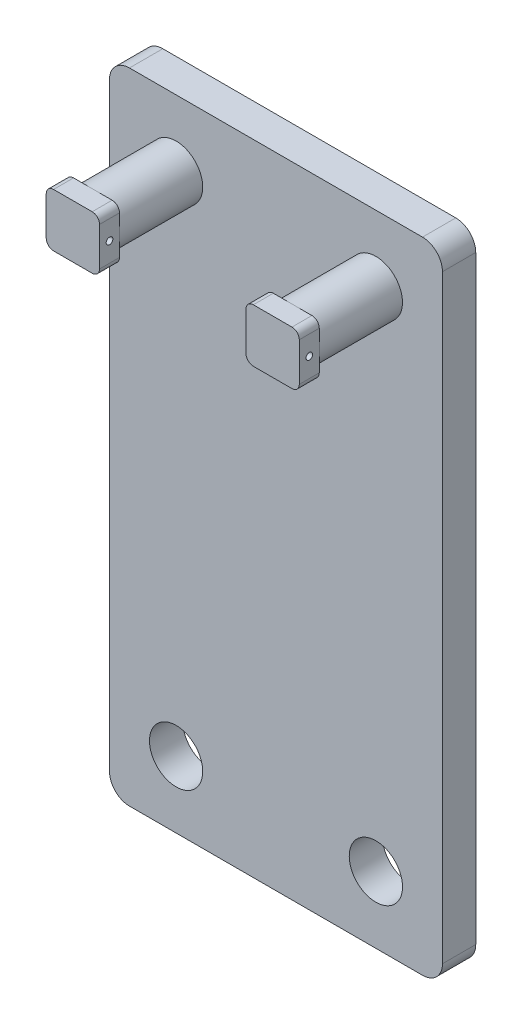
ISO-10303-21;
HEADER;
FILE_DESCRIPTION(('STEP AP214'),'2;1');
FILE_NAME('part.step','',(''),(''),'','','');
FILE_SCHEMA(('AUTOMOTIVE_DESIGN { 1 0 10303 214 1 1 1 1 }'));
ENDSEC;
DATA;
#1=APPLICATION_CONTEXT('core data for automotive mechanical design processes');
#2=APPLICATION_PROTOCOL_DEFINITION('international standard','automotive_design',2000,#1);
#3=PRODUCT_CONTEXT('',#1,'mechanical');
#4=PRODUCT('Part','Part','',(#3));
#5=PRODUCT_RELATED_PRODUCT_CATEGORY('part','',(#4));
#6=PRODUCT_DEFINITION_FORMATION('','',#4);
#7=PRODUCT_DEFINITION_CONTEXT('part definition',#1,'design');
#8=PRODUCT_DEFINITION('design','',#6,#7);
#9=PRODUCT_DEFINITION_SHAPE('','',#8);
#10=(LENGTH_UNIT() NAMED_UNIT(*) SI_UNIT(.MILLI.,.METRE.));
#11=(NAMED_UNIT(*) PLANE_ANGLE_UNIT() SI_UNIT($,.RADIAN.));
#12=(NAMED_UNIT(*) SI_UNIT($,.STERADIAN.) SOLID_ANGLE_UNIT());
#13=UNCERTAINTY_MEASURE_WITH_UNIT(LENGTH_MEASURE(1.E-05),#10,'distance_accuracy_value','');
#14=(GEOMETRIC_REPRESENTATION_CONTEXT(3) GLOBAL_UNCERTAINTY_ASSIGNED_CONTEXT((#13)) GLOBAL_UNIT_ASSIGNED_CONTEXT((#10,
#11,#12)) REPRESENTATION_CONTEXT('',''));
#15=CARTESIAN_POINT('',(0.,0.,0.));
#16=DIRECTION('',(0.,0.,1.));
#17=DIRECTION('',(1.,0.,0.));
#18=AXIS2_PLACEMENT_3D('',#15,#16,#17);
#19=CARTESIAN_POINT('',(179.,-15.6883506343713,205.));
#20=DIRECTION('',(0.,0.,-1.));
#21=DIRECTION('',(-1.,0.,0.));
#22=AXIS2_PLACEMENT_3D('',#19,#20,#21);
#23=CYLINDRICAL_SURFACE('',#22,11.);
#24=DIRECTION('',(0.,0.,-1.));
#25=VECTOR('',#24,1.);
#26=CARTESIAN_POINT('',(179.,-4.68835063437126,205.));
#27=LINE('',#26,#25);
#28=CARTESIAN_POINT('',(179.,-4.68835063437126,205.));
#29=VERTEX_POINT('',#28);
#30=CARTESIAN_POINT('',(179.,-4.68835063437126,175.));
#31=VERTEX_POINT('',#30);
#32=EDGE_CURVE('E448',#29,#31,#27,.T.);
#33=ORIENTED_EDGE('',*,*,#32,.F.);
#34=CARTESIAN_POINT('',(179.,-15.6883506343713,205.));
#35=DIRECTION('',(0.,0.,1.));
#36=DIRECTION('',(1.,0.,0.));
#37=AXIS2_PLACEMENT_3D('',#34,#35,#36);
#38=CIRCLE('',#37,11.);
#39=CARTESIAN_POINT('',(190.,-15.6883506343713,205.));
#40=VERTEX_POINT('',#39);
#41=EDGE_CURVE('E41',#40,#29,#38,.T.);
#42=ORIENTED_EDGE('',*,*,#41,.F.);
#43=DIRECTION('',(0.,0.,-1.));
#44=VECTOR('',#43,1.);
#45=CARTESIAN_POINT('',(190.,-15.6883506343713,205.));
#46=LINE('',#45,#44);
#47=CARTESIAN_POINT('',(190.,-15.6883506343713,175.));
#48=VERTEX_POINT('',#47);
#49=EDGE_CURVE('E451',#48,#40,#46,.F.);
#50=ORIENTED_EDGE('',*,*,#49,.F.);
#51=CARTESIAN_POINT('',(179.,-15.6883506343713,175.));
#52=DIRECTION('',(0.,0.,1.));
#53=DIRECTION('',(1.,0.,0.));
#54=AXIS2_PLACEMENT_3D('',#51,#52,#53);
#55=CIRCLE('',#54,11.);
#56=EDGE_CURVE('E11',#31,#48,#55,.F.);
#57=ORIENTED_EDGE('',*,*,#56,.F.);
#58=EDGE_LOOP('',(#33,#42,#50,#57));
#59=FACE_BOUND('',#58,.T.);
#60=ADVANCED_FACE('F34',(#59),#23,.T.);
#61=CARTESIAN_POINT('',(179.,-73.6883506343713,205.));
#62=DIRECTION('',(0.,0.,-1.));
#63=DIRECTION('',(-1.,0.,0.));
#64=AXIS2_PLACEMENT_3D('',#61,#62,#63);
#65=CYLINDRICAL_SURFACE('',#64,11.);
#66=DIRECTION('',(0.,0.,-1.));
#67=VECTOR('',#66,1.);
#68=CARTESIAN_POINT('',(190.,-73.6883506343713,205.));
#69=LINE('',#68,#67);
#70=CARTESIAN_POINT('',(190.,-73.6883506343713,205.));
#71=VERTEX_POINT('',#70);
#72=CARTESIAN_POINT('',(190.,-73.6883506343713,175.));
#73=VERTEX_POINT('',#72);
#74=EDGE_CURVE('E437',#71,#73,#69,.T.);
#75=ORIENTED_EDGE('',*,*,#74,.F.);
#76=CARTESIAN_POINT('',(179.,-73.6883506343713,205.));
#77=DIRECTION('',(0.,0.,1.));
#78=DIRECTION('',(1.,0.,0.));
#79=AXIS2_PLACEMENT_3D('',#76,#77,#78);
#80=CIRCLE('',#79,11.);
#81=CARTESIAN_POINT('',(179.,-84.6883506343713,205.));
#82=VERTEX_POINT('',#81);
#83=EDGE_CURVE('E443',#82,#71,#80,.T.);
#84=ORIENTED_EDGE('',*,*,#83,.F.);
#85=DIRECTION('',(0.,0.,-1.));
#86=VECTOR('',#85,1.);
#87=CARTESIAN_POINT('',(179.,-84.6883506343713,205.));
#88=LINE('',#87,#86);
#89=CARTESIAN_POINT('',(179.,-84.6883506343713,175.));
#90=VERTEX_POINT('',#89);
#91=EDGE_CURVE('E440',#90,#82,#88,.F.);
#92=ORIENTED_EDGE('',*,*,#91,.F.);
#93=CARTESIAN_POINT('',(179.,-73.6883506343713,175.));
#94=DIRECTION('',(0.,0.,1.));
#95=DIRECTION('',(1.,0.,0.));
#96=AXIS2_PLACEMENT_3D('',#93,#94,#95);
#97=CIRCLE('',#96,11.);
#98=EDGE_CURVE('E446',#73,#90,#97,.F.);
#99=ORIENTED_EDGE('',*,*,#98,.F.);
#100=EDGE_LOOP('',(#75,#84,#92,#99));
#101=FACE_BOUND('',#100,.T.);
#102=ADVANCED_FACE('F481',(#101),#65,.T.);
#103=CARTESIAN_POINT('',(121.,-73.6883506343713,205.));
#104=DIRECTION('',(0.,0.,-1.));
#105=DIRECTION('',(-1.,0.,0.));
#106=AXIS2_PLACEMENT_3D('',#103,#104,#105);
#107=CYLINDRICAL_SURFACE('',#106,11.);
#108=DIRECTION('',(0.,0.,-1.));
#109=VECTOR('',#108,1.);
#110=CARTESIAN_POINT('',(121.,-84.6883506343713,205.));
#111=LINE('',#110,#109);
#112=CARTESIAN_POINT('',(121.,-84.6883506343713,205.));
#113=VERTEX_POINT('',#112);
#114=CARTESIAN_POINT('',(121.,-84.6883506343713,175.));
#115=VERTEX_POINT('',#114);
#116=EDGE_CURVE('E428',#113,#115,#111,.T.);
#117=ORIENTED_EDGE('',*,*,#116,.F.);
#118=CARTESIAN_POINT('',(121.,-73.6883506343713,205.));
#119=DIRECTION('',(0.,0.,1.));
#120=DIRECTION('',(1.,0.,0.));
#121=AXIS2_PLACEMENT_3D('',#118,#119,#120);
#122=CIRCLE('',#121,11.);
#123=CARTESIAN_POINT('',(110.,-73.6883506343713,205.));
#124=VERTEX_POINT('',#123);
#125=EDGE_CURVE('E433',#124,#113,#122,.T.);
#126=ORIENTED_EDGE('',*,*,#125,.F.);
#127=DIRECTION('',(0.,0.,-1.));
#128=VECTOR('',#127,1.);
#129=CARTESIAN_POINT('',(110.,-73.6883506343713,205.));
#130=LINE('',#129,#128);
#131=CARTESIAN_POINT('',(110.,-73.6883506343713,175.));
#132=VERTEX_POINT('',#131);
#133=EDGE_CURVE('E431',#132,#124,#130,.F.);
#134=ORIENTED_EDGE('',*,*,#133,.F.);
#135=CARTESIAN_POINT('',(121.,-73.6883506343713,175.));
#136=DIRECTION('',(0.,0.,1.));
#137=DIRECTION('',(1.,0.,0.));
#138=AXIS2_PLACEMENT_3D('',#135,#136,#137);
#139=CIRCLE('',#138,11.);
#140=EDGE_CURVE('E221',#115,#132,#139,.F.);
#141=ORIENTED_EDGE('',*,*,#140,.F.);
#142=EDGE_LOOP('',(#117,#126,#134,#141));
#143=FACE_BOUND('',#142,.T.);
#144=ADVANCED_FACE('F485',(#143),#107,.T.);
#145=CARTESIAN_POINT('',(121.,-15.6883506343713,205.));
#146=DIRECTION('',(0.,0.,1.));
#147=DIRECTION('',(1.,0.,0.));
#148=AXIS2_PLACEMENT_3D('',#145,#146,#147);
#149=CYLINDRICAL_SURFACE('',#148,11.);
#150=DIRECTION('',(0.,0.,1.));
#151=VECTOR('',#150,1.);
#152=CARTESIAN_POINT('',(121.,-4.68835063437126,205.));
#153=LINE('',#152,#151);
#154=CARTESIAN_POINT('',(121.,-4.68835063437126,175.));
#155=VERTEX_POINT('',#154);
#156=CARTESIAN_POINT('',(121.,-4.68835063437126,205.));
#157=VERTEX_POINT('',#156);
#158=EDGE_CURVE('E419',#155,#157,#153,.T.);
#159=ORIENTED_EDGE('',*,*,#158,.F.);
#160=CARTESIAN_POINT('',(121.,-15.6883506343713,175.));
#161=DIRECTION('',(0.,0.,1.));
#162=DIRECTION('',(1.,0.,0.));
#163=AXIS2_PLACEMENT_3D('',#160,#161,#162);
#164=CIRCLE('',#163,11.);
#165=CARTESIAN_POINT('',(110.,-15.6883506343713,175.));
#166=VERTEX_POINT('',#165);
#167=EDGE_CURVE('E423',#166,#155,#164,.F.);
#168=ORIENTED_EDGE('',*,*,#167,.F.);
#169=DIRECTION('',(0.,0.,1.));
#170=VECTOR('',#169,1.);
#171=CARTESIAN_POINT('',(110.,-15.6883506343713,205.));
#172=LINE('',#171,#170);
#173=CARTESIAN_POINT('',(110.,-15.6883506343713,205.));
#174=VERTEX_POINT('',#173);
#175=EDGE_CURVE('E252',#174,#166,#172,.F.);
#176=ORIENTED_EDGE('',*,*,#175,.F.);
#177=CARTESIAN_POINT('',(121.,-15.6883506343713,205.));
#178=DIRECTION('',(0.,0.,1.));
#179=DIRECTION('',(1.,0.,0.));
#180=AXIS2_PLACEMENT_3D('',#177,#178,#179);
#181=CIRCLE('',#180,11.);
#182=EDGE_CURVE('E425',#157,#174,#181,.T.);
#183=ORIENTED_EDGE('',*,*,#182,.F.);
#184=EDGE_LOOP('',(#159,#168,#176,#183));
#185=FACE_BOUND('',#184,.T.);
#186=ADVANCED_FACE('F490',(#185),#149,.T.);
#187=CARTESIAN_POINT('',(-179.,-73.6883506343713,205.));
#188=DIRECTION('',(0.,0.,1.));
#189=DIRECTION('',(1.,0.,0.));
#190=AXIS2_PLACEMENT_3D('',#187,#188,#189);
#191=CYLINDRICAL_SURFACE('',#190,11.);
#192=DIRECTION('',(0.,0.,1.));
#193=VECTOR('',#192,1.);
#194=CARTESIAN_POINT('',(-190.,-73.6883506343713,205.));
#195=LINE('',#194,#193);
#196=CARTESIAN_POINT('',(-190.,-73.6883506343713,175.));
#197=VERTEX_POINT('',#196);
#198=CARTESIAN_POINT('',(-190.,-73.6883506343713,205.));
#199=VERTEX_POINT('',#198);
#200=EDGE_CURVE('E409',#197,#199,#195,.T.);
#201=ORIENTED_EDGE('',*,*,#200,.F.);
#202=CARTESIAN_POINT('',(-179.,-73.6883506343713,175.));
#203=DIRECTION('',(0.,0.,1.));
#204=DIRECTION('',(1.,0.,0.));
#205=AXIS2_PLACEMENT_3D('',#202,#203,#204);
#206=CIRCLE('',#205,11.);
#207=CARTESIAN_POINT('',(-179.,-84.6883506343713,175.));
#208=VERTEX_POINT('',#207);
#209=EDGE_CURVE('E415',#208,#197,#206,.F.);
#210=ORIENTED_EDGE('',*,*,#209,.F.);
#211=DIRECTION('',(0.,0.,1.));
#212=VECTOR('',#211,1.);
#213=CARTESIAN_POINT('',(-179.,-84.6883506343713,205.));
#214=LINE('',#213,#212);
#215=CARTESIAN_POINT('',(-179.,-84.6883506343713,205.));
#216=VERTEX_POINT('',#215);
#217=EDGE_CURVE('E412',#216,#208,#214,.F.);
#218=ORIENTED_EDGE('',*,*,#217,.F.);
#219=CARTESIAN_POINT('',(-179.,-73.6883506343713,205.));
#220=DIRECTION('',(0.,0.,1.));
#221=DIRECTION('',(1.,0.,0.));
#222=AXIS2_PLACEMENT_3D('',#219,#220,#221);
#223=CIRCLE('',#222,11.);
#224=EDGE_CURVE('E417',#199,#216,#223,.T.);
#225=ORIENTED_EDGE('',*,*,#224,.F.);
#226=EDGE_LOOP('',(#201,#210,#218,#225));
#227=FACE_BOUND('',#226,.T.);
#228=ADVANCED_FACE('F497',(#227),#191,.T.);
#229=CARTESIAN_POINT('',(-121.,-73.6883506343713,205.));
#230=DIRECTION('',(0.,0.,-1.));
#231=DIRECTION('',(-1.,0.,0.));
#232=AXIS2_PLACEMENT_3D('',#229,#230,#231);
#233=CYLINDRICAL_SURFACE('',#232,11.);
#234=DIRECTION('',(0.,0.,-1.));
#235=VECTOR('',#234,1.);
#236=CARTESIAN_POINT('',(-110.,-73.6883506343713,205.));
#237=LINE('',#236,#235);
#238=CARTESIAN_POINT('',(-110.,-73.6883506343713,205.));
#239=VERTEX_POINT('',#238);
#240=CARTESIAN_POINT('',(-110.,-73.6883506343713,175.));
#241=VERTEX_POINT('',#240);
#242=EDGE_CURVE('E399',#239,#241,#237,.T.);
#243=ORIENTED_EDGE('',*,*,#242,.F.);
#244=CARTESIAN_POINT('',(-121.,-73.6883506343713,205.));
#245=DIRECTION('',(0.,0.,1.));
#246=DIRECTION('',(1.,0.,0.));
#247=AXIS2_PLACEMENT_3D('',#244,#245,#246);
#248=CIRCLE('',#247,11.);
#249=CARTESIAN_POINT('',(-121.,-84.6883506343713,205.));
#250=VERTEX_POINT('',#249);
#251=EDGE_CURVE('E405',#250,#239,#248,.T.);
#252=ORIENTED_EDGE('',*,*,#251,.F.);
#253=DIRECTION('',(0.,0.,-1.));
#254=VECTOR('',#253,1.);
#255=CARTESIAN_POINT('',(-121.,-84.6883506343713,205.));
#256=LINE('',#255,#254);
#257=CARTESIAN_POINT('',(-121.,-84.6883506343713,175.));
#258=VERTEX_POINT('',#257);
#259=EDGE_CURVE('E402',#258,#250,#256,.F.);
#260=ORIENTED_EDGE('',*,*,#259,.F.);
#261=CARTESIAN_POINT('',(-121.,-73.6883506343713,175.));
#262=DIRECTION('',(0.,0.,1.));
#263=DIRECTION('',(1.,0.,0.));
#264=AXIS2_PLACEMENT_3D('',#261,#262,#263);
#265=CIRCLE('',#264,11.);
#266=EDGE_CURVE('E407',#241,#258,#265,.F.);
#267=ORIENTED_EDGE('',*,*,#266,.F.);
#268=EDGE_LOOP('',(#243,#252,#260,#267));
#269=FACE_BOUND('',#268,.T.);
#270=ADVANCED_FACE('F501',(#269),#233,.T.);
#271=CARTESIAN_POINT('',(-121.,-15.6883506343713,205.));
#272=DIRECTION('',(0.,0.,-1.));
#273=DIRECTION('',(-1.,0.,0.));
#274=AXIS2_PLACEMENT_3D('',#271,#272,#273);
#275=CYLINDRICAL_SURFACE('',#274,11.);
#276=DIRECTION('',(0.,0.,-1.));
#277=VECTOR('',#276,1.);
#278=CARTESIAN_POINT('',(-121.,-4.68835063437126,205.));
#279=LINE('',#278,#277);
#280=CARTESIAN_POINT('',(-121.,-4.68835063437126,205.));
#281=VERTEX_POINT('',#280);
#282=CARTESIAN_POINT('',(-121.,-4.68835063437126,175.));
#283=VERTEX_POINT('',#282);
#284=EDGE_CURVE('E389',#281,#283,#279,.T.);
#285=ORIENTED_EDGE('',*,*,#284,.F.);
#286=CARTESIAN_POINT('',(-121.,-15.6883506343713,205.));
#287=DIRECTION('',(0.,0.,1.));
#288=DIRECTION('',(1.,0.,0.));
#289=AXIS2_PLACEMENT_3D('',#286,#287,#288);
#290=CIRCLE('',#289,11.);
#291=CARTESIAN_POINT('',(-110.,-15.6883506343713,205.));
#292=VERTEX_POINT('',#291);
#293=EDGE_CURVE('E395',#292,#281,#290,.T.);
#294=ORIENTED_EDGE('',*,*,#293,.F.);
#295=DIRECTION('',(0.,0.,-1.));
#296=VECTOR('',#295,1.);
#297=CARTESIAN_POINT('',(-110.,-15.6883506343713,205.));
#298=LINE('',#297,#296);
#299=CARTESIAN_POINT('',(-110.,-15.6883506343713,175.));
#300=VERTEX_POINT('',#299);
#301=EDGE_CURVE('E392',#300,#292,#298,.F.);
#302=ORIENTED_EDGE('',*,*,#301,.F.);
#303=CARTESIAN_POINT('',(-121.,-15.6883506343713,175.));
#304=DIRECTION('',(0.,0.,1.));
#305=DIRECTION('',(1.,0.,0.));
#306=AXIS2_PLACEMENT_3D('',#303,#304,#305);
#307=CIRCLE('',#306,11.);
#308=EDGE_CURVE('E397',#283,#300,#307,.F.);
#309=ORIENTED_EDGE('',*,*,#308,.F.);
#310=EDGE_LOOP('',(#285,#294,#302,#309));
#311=FACE_BOUND('',#310,.T.);
#312=ADVANCED_FACE('F505',(#311),#275,.T.);
#313=CARTESIAN_POINT('',(-179.,-15.6883506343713,205.));
#314=DIRECTION('',(0.,0.,1.));
#315=DIRECTION('',(1.,0.,0.));
#316=AXIS2_PLACEMENT_3D('',#313,#314,#315);
#317=CYLINDRICAL_SURFACE('',#316,11.);
#318=DIRECTION('',(0.,0.,1.));
#319=VECTOR('',#318,1.);
#320=CARTESIAN_POINT('',(-179.,-4.68835063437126,205.));
#321=LINE('',#320,#319);
#322=CARTESIAN_POINT('',(-179.,-4.68835063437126,175.));
#323=VERTEX_POINT('',#322);
#324=CARTESIAN_POINT('',(-179.,-4.68835063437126,205.));
#325=VERTEX_POINT('',#324);
#326=EDGE_CURVE('E375',#323,#325,#321,.T.);
#327=ORIENTED_EDGE('',*,*,#326,.F.);
#328=CARTESIAN_POINT('',(-179.,-15.6883506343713,175.));
#329=DIRECTION('',(0.,0.,1.));
#330=DIRECTION('',(1.,0.,0.));
#331=AXIS2_PLACEMENT_3D('',#328,#329,#330);
#332=CIRCLE('',#331,11.);
#333=CARTESIAN_POINT('',(-190.,-15.6883506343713,175.));
#334=VERTEX_POINT('',#333);
#335=EDGE_CURVE('E385',#334,#323,#332,.F.);
#336=ORIENTED_EDGE('',*,*,#335,.F.);
#337=DIRECTION('',(0.,0.,1.));
#338=VECTOR('',#337,1.);
#339=CARTESIAN_POINT('',(-190.,-15.6883506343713,205.));
#340=LINE('',#339,#338);
#341=CARTESIAN_POINT('',(-190.,-15.6883506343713,205.));
#342=VERTEX_POINT('',#341);
#343=EDGE_CURVE('E382',#342,#334,#340,.F.);
#344=ORIENTED_EDGE('',*,*,#343,.F.);
#345=CARTESIAN_POINT('',(-179.,-15.6883506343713,205.));
#346=DIRECTION('',(0.,0.,1.));
#347=DIRECTION('',(1.,0.,0.));
#348=AXIS2_PLACEMENT_3D('',#345,#346,#347);
#349=CIRCLE('',#348,11.);
#350=EDGE_CURVE('E387',#325,#342,#349,.T.);
#351=ORIENTED_EDGE('',*,*,#350,.F.);
#352=EDGE_LOOP('',(#327,#336,#344,#351));
#353=FACE_BOUND('',#352,.T.);
#354=ADVANCED_FACE('F509',(#353),#317,.T.);
#355=CARTESIAN_POINT('',(220.,-874.688350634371,50.));
#356=DIRECTION('',(0.,0.,-1.));
#357=DIRECTION('',(-1.,0.,0.));
#358=AXIS2_PLACEMENT_3D('',#355,#356,#357);
#359=CYLINDRICAL_SURFACE('',#358,30.);
#360=DIRECTION('',(0.,0.,-1.));
#361=VECTOR('',#360,1.);
#362=CARTESIAN_POINT('',(250.,-874.688350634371,50.));
#363=LINE('',#362,#361);
#364=CARTESIAN_POINT('',(250.,-874.688350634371,50.));
#365=VERTEX_POINT('',#364);
#366=CARTESIAN_POINT('',(250.,-874.688350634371,0.));
#367=VERTEX_POINT('',#366);
#368=EDGE_CURVE('E365',#365,#367,#363,.T.);
#369=ORIENTED_EDGE('',*,*,#368,.F.);
#370=CARTESIAN_POINT('',(220.,-874.688350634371,50.));
#371=DIRECTION('',(0.,0.,1.));
#372=DIRECTION('',(1.,0.,0.));
#373=AXIS2_PLACEMENT_3D('',#370,#371,#372);
#374=CIRCLE('',#373,30.);
#375=CARTESIAN_POINT('',(220.,-904.688350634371,50.));
#376=VERTEX_POINT('',#375);
#377=EDGE_CURVE('E371',#376,#365,#374,.T.);
#378=ORIENTED_EDGE('',*,*,#377,.F.);
#379=DIRECTION('',(0.,0.,-1.));
#380=VECTOR('',#379,1.);
#381=CARTESIAN_POINT('',(220.,-904.688350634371,50.));
#382=LINE('',#381,#380);
#383=CARTESIAN_POINT('',(220.,-904.688350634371,0.));
#384=VERTEX_POINT('',#383);
#385=EDGE_CURVE('E368',#384,#376,#382,.F.);
#386=ORIENTED_EDGE('',*,*,#385,.F.);
#387=CARTESIAN_POINT('',(220.,-874.688350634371,0.));
#388=DIRECTION('',(0.,0.,1.));
#389=DIRECTION('',(1.,0.,0.));
#390=AXIS2_PLACEMENT_3D('',#387,#388,#389);
#391=CIRCLE('',#390,30.);
#392=EDGE_CURVE('E373',#367,#384,#391,.F.);
#393=ORIENTED_EDGE('',*,*,#392,.F.);
#394=EDGE_LOOP('',(#369,#378,#386,#393));
#395=FACE_BOUND('',#394,.T.);
#396=ADVANCED_FACE('F513',(#395),#359,.T.);
#397=CARTESIAN_POINT('',(-220.,-874.688350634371,50.));
#398=DIRECTION('',(0.,0.,1.));
#399=DIRECTION('',(1.,0.,0.));
#400=AXIS2_PLACEMENT_3D('',#397,#398,#399);
#401=CYLINDRICAL_SURFACE('',#400,30.);
#402=DIRECTION('',(0.,0.,1.));
#403=VECTOR('',#402,1.);
#404=CARTESIAN_POINT('',(-250.,-874.688350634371,50.));
#405=LINE('',#404,#403);
#406=CARTESIAN_POINT('',(-250.,-874.688350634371,0.));
#407=VERTEX_POINT('',#406);
#408=CARTESIAN_POINT('',(-250.,-874.688350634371,50.));
#409=VERTEX_POINT('',#408);
#410=EDGE_CURVE('E355',#407,#409,#405,.T.);
#411=ORIENTED_EDGE('',*,*,#410,.F.);
#412=CARTESIAN_POINT('',(-220.,-874.688350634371,0.));
#413=DIRECTION('',(0.,0.,1.));
#414=DIRECTION('',(1.,0.,0.));
#415=AXIS2_PLACEMENT_3D('',#412,#413,#414);
#416=CIRCLE('',#415,30.);
#417=CARTESIAN_POINT('',(-220.,-904.688350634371,0.));
#418=VERTEX_POINT('',#417);
#419=EDGE_CURVE('E361',#418,#407,#416,.F.);
#420=ORIENTED_EDGE('',*,*,#419,.F.);
#421=DIRECTION('',(0.,0.,1.));
#422=VECTOR('',#421,1.);
#423=CARTESIAN_POINT('',(-220.,-904.688350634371,50.));
#424=LINE('',#423,#422);
#425=CARTESIAN_POINT('',(-220.,-904.688350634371,50.));
#426=VERTEX_POINT('',#425);
#427=EDGE_CURVE('E358',#426,#418,#424,.F.);
#428=ORIENTED_EDGE('',*,*,#427,.F.);
#429=CARTESIAN_POINT('',(-220.,-874.688350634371,50.));
#430=DIRECTION('',(0.,0.,1.));
#431=DIRECTION('',(1.,0.,0.));
#432=AXIS2_PLACEMENT_3D('',#429,#430,#431);
#433=CIRCLE('',#432,30.);
#434=EDGE_CURVE('E363',#409,#426,#433,.T.);
#435=ORIENTED_EDGE('',*,*,#434,.F.);
#436=EDGE_LOOP('',(#411,#420,#428,#435));
#437=FACE_BOUND('',#436,.T.);
#438=ADVANCED_FACE('F517',(#437),#401,.T.);
#439=CARTESIAN_POINT('',(220.,25.3116493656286,50.));
#440=DIRECTION('',(0.,0.,-1.));
#441=DIRECTION('',(-1.,0.,0.));
#442=AXIS2_PLACEMENT_3D('',#439,#440,#441);
#443=CYLINDRICAL_SURFACE('',#442,30.);
#444=DIRECTION('',(0.,0.,-1.));
#445=VECTOR('',#444,1.);
#446=CARTESIAN_POINT('',(220.,55.3116493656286,50.));
#447=LINE('',#446,#445);
#448=CARTESIAN_POINT('',(220.,55.3116493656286,50.));
#449=VERTEX_POINT('',#448);
#450=CARTESIAN_POINT('',(220.,55.3116493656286,0.));
#451=VERTEX_POINT('',#450);
#452=EDGE_CURVE('E344',#449,#451,#447,.T.);
#453=ORIENTED_EDGE('',*,*,#452,.F.);
#454=CARTESIAN_POINT('',(220.,25.3116493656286,50.));
#455=DIRECTION('',(0.,0.,1.));
#456=DIRECTION('',(1.,0.,0.));
#457=AXIS2_PLACEMENT_3D('',#454,#455,#456);
#458=CIRCLE('',#457,30.);
#459=CARTESIAN_POINT('',(250.000000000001,25.3116493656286,50.));
#460=VERTEX_POINT('',#459);
#461=EDGE_CURVE('E350',#460,#449,#458,.T.);
#462=ORIENTED_EDGE('',*,*,#461,.F.);
#463=DIRECTION('',(0.,0.,-1.));
#464=VECTOR('',#463,1.);
#465=CARTESIAN_POINT('',(250.,25.3116493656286,50.));
#466=LINE('',#465,#464);
#467=CARTESIAN_POINT('',(250.,25.3116493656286,0.));
#468=VERTEX_POINT('',#467);
#469=EDGE_CURVE('E347',#468,#460,#466,.F.);
#470=ORIENTED_EDGE('',*,*,#469,.F.);
#471=CARTESIAN_POINT('',(220.,25.3116493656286,0.));
#472=DIRECTION('',(0.,0.,1.));
#473=DIRECTION('',(1.,0.,0.));
#474=AXIS2_PLACEMENT_3D('',#471,#472,#473);
#475=CIRCLE('',#474,30.);
#476=EDGE_CURVE('E352',#451,#468,#475,.F.);
#477=ORIENTED_EDGE('',*,*,#476,.F.);
#478=EDGE_LOOP('',(#453,#462,#470,#477));
#479=FACE_BOUND('',#478,.T.);
#480=ADVANCED_FACE('F521',(#479),#443,.T.);
#481=CARTESIAN_POINT('',(-220.000000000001,25.3116493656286,50.));
#482=DIRECTION('',(0.,0.,1.));
#483=DIRECTION('',(1.,0.,0.));
#484=AXIS2_PLACEMENT_3D('',#481,#482,#483);
#485=CYLINDRICAL_SURFACE('',#484,30.);
#486=DIRECTION('',(0.,0.,1.));
#487=VECTOR('',#486,1.);
#488=CARTESIAN_POINT('',(-220.000000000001,55.3116493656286,50.));
#489=LINE('',#488,#487);
#490=CARTESIAN_POINT('',(-220.000000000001,55.3116493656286,0.));
#491=VERTEX_POINT('',#490);
#492=CARTESIAN_POINT('',(-220.000000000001,55.3116493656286,50.));
#493=VERTEX_POINT('',#492);
#494=EDGE_CURVE('E323',#491,#493,#489,.T.);
#495=ORIENTED_EDGE('',*,*,#494,.F.);
#496=CARTESIAN_POINT('',(-220.000000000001,25.3116493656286,0.));
#497=DIRECTION('',(0.,0.,1.));
#498=DIRECTION('',(1.,0.,0.));
#499=AXIS2_PLACEMENT_3D('',#496,#497,#498);
#500=CIRCLE('',#499,30.);
#501=CARTESIAN_POINT('',(-250.000000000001,25.3116493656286,0.));
#502=VERTEX_POINT('',#501);
#503=EDGE_CURVE('E339',#502,#491,#500,.F.);
#504=ORIENTED_EDGE('',*,*,#503,.F.);
#505=DIRECTION('',(0.,0.,1.));
#506=VECTOR('',#505,1.);
#507=CARTESIAN_POINT('',(-250.000000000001,25.3116493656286,50.));
#508=LINE('',#507,#506);
#509=CARTESIAN_POINT('',(-250.,25.3116493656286,50.));
#510=VERTEX_POINT('',#509);
#511=EDGE_CURVE('E336',#510,#502,#508,.F.);
#512=ORIENTED_EDGE('',*,*,#511,.F.);
#513=CARTESIAN_POINT('',(-220.000000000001,25.3116493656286,50.));
#514=DIRECTION('',(0.,0.,1.));
#515=DIRECTION('',(1.,0.,0.));
#516=AXIS2_PLACEMENT_3D('',#513,#514,#515);
#517=CIRCLE('',#516,30.);
#518=EDGE_CURVE('E342',#493,#510,#517,.T.);
#519=ORIENTED_EDGE('',*,*,#518,.F.);
#520=EDGE_LOOP('',(#495,#504,#512,#519));
#521=FACE_BOUND('',#520,.T.);
#522=ADVANCED_FACE('F525',(#521),#485,.T.);
#523=CARTESIAN_POINT('',(250.,55.3116493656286,50.));
#524=DIRECTION('',(-1.,0.,0.));
#525=DIRECTION('',(0.,0.,1.));
#526=AXIS2_PLACEMENT_3D('',#523,#524,#525);
#527=PLANE('',#526);
#528=DIRECTION('',(0.,1.,0.));
#529=VECTOR('',#528,1.);
#530=CARTESIAN_POINT('',(250.,-804.688350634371,50.));
#531=LINE('',#530,#529);
#532=EDGE_CURVE('E312',#365,#460,#531,.T.);
#533=ORIENTED_EDGE('',*,*,#532,.F.);
#534=ORIENTED_EDGE('',*,*,#368,.T.);
#535=DIRECTION('',(0.,1.,0.));
#536=VECTOR('',#535,1.);
#537=CARTESIAN_POINT('',(250.,55.3116493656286,0.));
#538=LINE('',#537,#536);
#539=EDGE_CURVE('E324',#367,#468,#538,.T.);
#540=ORIENTED_EDGE('',*,*,#539,.T.);
#541=ORIENTED_EDGE('',*,*,#469,.T.);
#542=EDGE_LOOP('',(#533,#534,#540,#541));
#543=FACE_BOUND('',#542,.T.);
#544=ADVANCED_FACE('F529',(#543),#527,.F.);
#545=CARTESIAN_POINT('',(250.,55.3116493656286,50.));
#546=DIRECTION('',(0.,-1.,0.));
#547=DIRECTION('',(0.,0.,-1.));
#548=AXIS2_PLACEMENT_3D('',#545,#546,#547);
#549=PLANE('',#548);
#550=DIRECTION('',(-1.,0.,0.));
#551=VECTOR('',#550,1.);
#552=CARTESIAN_POINT('',(250.,55.3116493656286,50.));
#553=LINE('',#552,#551);
#554=EDGE_CURVE('E314',#449,#493,#553,.T.);
#555=ORIENTED_EDGE('',*,*,#554,.F.);
#556=ORIENTED_EDGE('',*,*,#452,.T.);
#557=DIRECTION('',(-1.,0.,0.));
#558=VECTOR('',#557,1.);
#559=CARTESIAN_POINT('',(250.,55.3116493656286,0.));
#560=LINE('',#559,#558);
#561=EDGE_CURVE('E326',#451,#491,#560,.T.);
#562=ORIENTED_EDGE('',*,*,#561,.T.);
#563=ORIENTED_EDGE('',*,*,#494,.T.);
#564=EDGE_LOOP('',(#555,#556,#562,#563));
#565=FACE_BOUND('',#564,.T.);
#566=ADVANCED_FACE('F533',(#565),#549,.F.);
#567=CARTESIAN_POINT('',(-250.,-804.688350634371,50.));
#568=DIRECTION('',(1.,0.,0.));
#569=DIRECTION('',(0.,1.,0.));
#570=AXIS2_PLACEMENT_3D('',#567,#568,#569);
#571=PLANE('',#570);
#572=DIRECTION('',(0.,-1.,0.));
#573=VECTOR('',#572,1.);
#574=CARTESIAN_POINT('',(-250.,-804.688350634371,0.));
#575=LINE('',#574,#573);
#576=EDGE_CURVE('E329',#502,#407,#575,.T.);
#577=ORIENTED_EDGE('',*,*,#576,.T.);
#578=ORIENTED_EDGE('',*,*,#410,.T.);
#579=DIRECTION('',(0.,-1.,0.));
#580=VECTOR('',#579,1.);
#581=CARTESIAN_POINT('',(-250.,55.3116493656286,50.));
#582=LINE('',#581,#580);
#583=EDGE_CURVE('E317',#510,#409,#582,.T.);
#584=ORIENTED_EDGE('',*,*,#583,.F.);
#585=ORIENTED_EDGE('',*,*,#511,.T.);
#586=EDGE_LOOP('',(#577,#578,#584,#585));
#587=FACE_BOUND('',#586,.T.);
#588=ADVANCED_FACE('F537',(#587),#571,.F.);
#589=CARTESIAN_POINT('',(-250.,-904.688350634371,50.));
#590=DIRECTION('',(0.,1.,0.));
#591=DIRECTION('',(-1.,0.,0.));
#592=AXIS2_PLACEMENT_3D('',#589,#590,#591);
#593=PLANE('',#592);
#594=DIRECTION('',(1.,0.,0.));
#595=VECTOR('',#594,1.);
#596=CARTESIAN_POINT('',(-250.,-904.688350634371,0.));
#597=LINE('',#596,#595);
#598=EDGE_CURVE('E315',#418,#384,#597,.T.);
#599=ORIENTED_EDGE('',*,*,#598,.T.);
#600=ORIENTED_EDGE('',*,*,#385,.T.);
#601=DIRECTION('',(1.,0.,0.));
#602=VECTOR('',#601,1.);
#603=CARTESIAN_POINT('',(-250.,-904.688350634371,50.));
#604=LINE('',#603,#602);
#605=EDGE_CURVE('E320',#426,#376,#604,.T.);
#606=ORIENTED_EDGE('',*,*,#605,.F.);
#607=ORIENTED_EDGE('',*,*,#427,.T.);
#608=EDGE_LOOP('',(#599,#600,#606,#607));
#609=FACE_BOUND('',#608,.T.);
#610=ADVANCED_FACE('F541',(#609),#593,.F.);
#611=CARTESIAN_POINT('',(0.,0.,50.));
#612=DIRECTION('',(0.,0.,1.));
#613=DIRECTION('',(1.,0.,0.));
#614=AXIS2_PLACEMENT_3D('',#611,#612,#613);
#615=PLANE('',#614);
#616=CARTESIAN_POINT('',(-150.,-44.6883506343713,50.));
#617=DIRECTION('',(0.,0.,1.));
#618=DIRECTION('',(-1.,0.,0.));
#619=AXIS2_PLACEMENT_3D('',#616,#617,#618);
#620=CIRCLE('',#619,40.);
#621=CARTESIAN_POINT('',(-190.,-44.6883506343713,50.));
#622=VERTEX_POINT('',#621);
#623=EDGE_CURVE('E286',#622,#622,#620,.T.);
#624=ORIENTED_EDGE('',*,*,#623,.F.);
#625=EDGE_LOOP('',(#624));
#626=FACE_BOUND('',#625,.T.);
#627=CARTESIAN_POINT('',(150.,-44.6883506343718,50.));
#628=DIRECTION('',(0.,0.,1.));
#629=DIRECTION('',(-1.,0.,0.));
#630=AXIS2_PLACEMENT_3D('',#627,#628,#629);
#631=CIRCLE('',#630,40.);
#632=CARTESIAN_POINT('',(110.,-44.6883506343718,50.));
#633=VERTEX_POINT('',#632);
#634=EDGE_CURVE('E248',#633,#633,#631,.T.);
#635=ORIENTED_EDGE('',*,*,#634,.F.);
#636=EDGE_LOOP('',(#635));
#637=FACE_BOUND('',#636,.T.);
#638=CARTESIAN_POINT('',(150.,-804.688350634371,50.));
#639=DIRECTION('',(0.,0.,1.));
#640=DIRECTION('',(-1.,0.,0.));
#641=AXIS2_PLACEMENT_3D('',#638,#639,#640);
#642=CIRCLE('',#641,40.);
#643=CARTESIAN_POINT('',(110.,-804.688350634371,50.));
#644=VERTEX_POINT('',#643);
#645=EDGE_CURVE('E306',#644,#644,#642,.T.);
#646=ORIENTED_EDGE('',*,*,#645,.F.);
#647=EDGE_LOOP('',(#646));
#648=FACE_BOUND('',#647,.T.);
#649=CARTESIAN_POINT('',(-150.,-804.688350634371,50.));
#650=DIRECTION('',(0.,0.,1.));
#651=DIRECTION('',(1.,0.,0.));
#652=AXIS2_PLACEMENT_3D('',#649,#650,#651);
#653=CIRCLE('',#652,40.);
#654=CARTESIAN_POINT('',(-110.,-804.688350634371,50.));
#655=VERTEX_POINT('',#654);
#656=EDGE_CURVE('E240',#655,#655,#653,.T.);
#657=ORIENTED_EDGE('',*,*,#656,.F.);
#658=EDGE_LOOP('',(#657));
#659=FACE_BOUND('',#658,.T.);
#660=ORIENTED_EDGE('',*,*,#605,.T.);
#661=ORIENTED_EDGE('',*,*,#377,.T.);
#662=ORIENTED_EDGE('',*,*,#532,.T.);
#663=ORIENTED_EDGE('',*,*,#461,.T.);
#664=ORIENTED_EDGE('',*,*,#554,.T.);
#665=ORIENTED_EDGE('',*,*,#518,.T.);
#666=ORIENTED_EDGE('',*,*,#583,.T.);
#667=ORIENTED_EDGE('',*,*,#434,.T.);
#668=EDGE_LOOP('',(#660,#661,#662,#663,#664,#665,#666,#667));
#669=FACE_BOUND('',#668,.T.);
#670=ADVANCED_FACE('F545',(#626,#637,#648,#659,#669),#615,.T.);
#671=CARTESIAN_POINT('',(0.,0.,0.));
#672=DIRECTION('',(0.,0.,1.));
#673=DIRECTION('',(1.,0.,0.));
#674=AXIS2_PLACEMENT_3D('',#671,#672,#673);
#675=PLANE('',#674);
#676=CARTESIAN_POINT('',(150.,-804.688350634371,0.));
#677=DIRECTION('',(0.,0.,1.));
#678=DIRECTION('',(1.,0.,0.));
#679=AXIS2_PLACEMENT_3D('',#676,#677,#678);
#680=CIRCLE('',#679,40.);
#681=CARTESIAN_POINT('',(190.,-804.688350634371,0.));
#682=VERTEX_POINT('',#681);
#683=EDGE_CURVE('E327',#682,#682,#680,.T.);
#684=ORIENTED_EDGE('',*,*,#683,.T.);
#685=EDGE_LOOP('',(#684));
#686=FACE_BOUND('',#685,.T.);
#687=CARTESIAN_POINT('',(-150.,-804.688350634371,0.));
#688=DIRECTION('',(0.,0.,1.));
#689=DIRECTION('',(1.,0.,0.));
#690=AXIS2_PLACEMENT_3D('',#687,#688,#689);
#691=CIRCLE('',#690,40.);
#692=CARTESIAN_POINT('',(-110.,-804.688350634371,0.));
#693=VERTEX_POINT('',#692);
#694=EDGE_CURVE('E309',#693,#693,#691,.T.);
#695=ORIENTED_EDGE('',*,*,#694,.T.);
#696=EDGE_LOOP('',(#695));
#697=FACE_BOUND('',#696,.T.);
#698=ORIENTED_EDGE('',*,*,#539,.F.);
#699=ORIENTED_EDGE('',*,*,#392,.T.);
#700=ORIENTED_EDGE('',*,*,#598,.F.);
#701=ORIENTED_EDGE('',*,*,#419,.T.);
#702=ORIENTED_EDGE('',*,*,#576,.F.);
#703=ORIENTED_EDGE('',*,*,#503,.T.);
#704=ORIENTED_EDGE('',*,*,#561,.F.);
#705=ORIENTED_EDGE('',*,*,#476,.T.);
#706=EDGE_LOOP('',(#698,#699,#700,#701,#702,#703,#704,#705));
#707=FACE_BOUND('',#706,.T.);
#708=ADVANCED_FACE('F547',(#686,#697,#707),#675,.F.);
#709=CARTESIAN_POINT('',(-150.,-804.688350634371,-25.));
#710=DIRECTION('',(0.,0.,1.));
#711=DIRECTION('',(1.,0.,0.));
#712=AXIS2_PLACEMENT_3D('',#709,#710,#711);
#713=CYLINDRICAL_SURFACE('',#712,40.);
#714=ORIENTED_EDGE('',*,*,#656,.T.);
#715=EDGE_LOOP('',(#714));
#716=FACE_BOUND('',#715,.T.);
#717=ORIENTED_EDGE('',*,*,#694,.F.);
#718=EDGE_LOOP('',(#717));
#719=FACE_BOUND('',#718,.T.);
#720=ADVANCED_FACE('F550',(#716,#719),#713,.F.);
#721=CARTESIAN_POINT('',(150.,-804.688350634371,-25.));
#722=DIRECTION('',(0.,0.,1.));
#723=DIRECTION('',(1.,0.,0.));
#724=AXIS2_PLACEMENT_3D('',#721,#722,#723);
#725=CYLINDRICAL_SURFACE('',#724,40.);
#726=ORIENTED_EDGE('',*,*,#645,.T.);
#727=EDGE_LOOP('',(#726));
#728=FACE_BOUND('',#727,.T.);
#729=ORIENTED_EDGE('',*,*,#683,.F.);
#730=EDGE_LOOP('',(#729));
#731=FACE_BOUND('',#730,.T.);
#732=ADVANCED_FACE('F557',(#728,#731),#725,.F.);
#733=CARTESIAN_POINT('',(150.,-44.6883506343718,175.));
#734=DIRECTION('',(0.,0.,-1.));
#735=DIRECTION('',(-1.,0.,0.));
#736=AXIS2_PLACEMENT_3D('',#733,#734,#735);
#737=CYLINDRICAL_SURFACE('',#736,40.);
#738=CARTESIAN_POINT('',(150.,-44.6883506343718,175.));
#739=DIRECTION('',(0.,0.,1.));
#740=DIRECTION('',(-1.,0.,0.));
#741=AXIS2_PLACEMENT_3D('',#738,#739,#740);
#742=CIRCLE('',#741,40.);
#743=CARTESIAN_POINT('',(110.,-44.6883506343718,175.));
#744=VERTEX_POINT('',#743);
#745=CARTESIAN_POINT('',(150.,-84.6883506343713,175.));
#746=VERTEX_POINT('',#745);
#747=EDGE_CURVE('E219',#744,#746,#742,.T.);
#748=ORIENTED_EDGE('',*,*,#747,.F.);
#749=CARTESIAN_POINT('',(150.,-4.68835063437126,175.));
#750=VERTEX_POINT('',#749);
#751=EDGE_CURVE('E236',#750,#744,#742,.T.);
#752=ORIENTED_EDGE('',*,*,#751,.F.);
#753=CARTESIAN_POINT('',(190.,-44.6883506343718,175.));
#754=VERTEX_POINT('',#753);
#755=EDGE_CURVE('E247',#754,#750,#742,.T.);
#756=ORIENTED_EDGE('',*,*,#755,.F.);
#757=EDGE_CURVE('E239',#746,#754,#742,.T.);
#758=ORIENTED_EDGE('',*,*,#757,.F.);
#759=EDGE_LOOP('',(#748,#752,#756,#758));
#760=FACE_BOUND('',#759,.T.);
#761=ORIENTED_EDGE('',*,*,#634,.T.);
#762=EDGE_LOOP('',(#761));
#763=FACE_BOUND('',#762,.T.);
#764=ADVANCED_FACE('F233',(#760,#763),#737,.T.);
#765=CARTESIAN_POINT('',(-150.,-44.6883506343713,175.));
#766=DIRECTION('',(0.,0.,-1.));
#767=DIRECTION('',(-1.,0.,0.));
#768=AXIS2_PLACEMENT_3D('',#765,#766,#767);
#769=CYLINDRICAL_SURFACE('',#768,40.);
#770=CARTESIAN_POINT('',(-150.,-44.6883506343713,175.));
#771=DIRECTION('',(0.,0.,1.));
#772=DIRECTION('',(-1.,0.,0.));
#773=AXIS2_PLACEMENT_3D('',#770,#771,#772);
#774=CIRCLE('',#773,40.);
#775=CARTESIAN_POINT('',(-190.,-44.6883506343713,175.));
#776=VERTEX_POINT('',#775);
#777=CARTESIAN_POINT('',(-150.,-84.6883506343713,175.));
#778=VERTEX_POINT('',#777);
#779=EDGE_CURVE('E297',#776,#778,#774,.T.);
#780=ORIENTED_EDGE('',*,*,#779,.F.);
#781=CARTESIAN_POINT('',(-150.,-4.68835063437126,175.));
#782=VERTEX_POINT('',#781);
#783=EDGE_CURVE('E301',#782,#776,#774,.T.);
#784=ORIENTED_EDGE('',*,*,#783,.F.);
#785=CARTESIAN_POINT('',(-110.,-44.6883506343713,175.));
#786=VERTEX_POINT('',#785);
#787=EDGE_CURVE('E919',#786,#782,#774,.T.);
#788=ORIENTED_EDGE('',*,*,#787,.F.);
#789=EDGE_CURVE('E300',#778,#786,#774,.T.);
#790=ORIENTED_EDGE('',*,*,#789,.F.);
#791=EDGE_LOOP('',(#780,#784,#788,#790));
#792=FACE_BOUND('',#791,.T.);
#793=ORIENTED_EDGE('',*,*,#623,.T.);
#794=EDGE_LOOP('',(#793));
#795=FACE_BOUND('',#794,.T.);
#796=ADVANCED_FACE('F564',(#792,#795),#769,.T.);
#797=CARTESIAN_POINT('',(0.,0.,175.));
#798=DIRECTION('',(0.,0.,1.));
#799=DIRECTION('',(1.,0.,0.));
#800=AXIS2_PLACEMENT_3D('',#797,#798,#799);
#801=PLANE('',#800);
#802=DIRECTION('',(1.,0.,0.));
#803=VECTOR('',#802,1.);
#804=CARTESIAN_POINT('',(-190.,-84.6883506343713,175.));
#805=LINE('',#804,#803);
#806=EDGE_CURVE('E279',#208,#778,#805,.T.);
#807=ORIENTED_EDGE('',*,*,#806,.F.);
#808=ORIENTED_EDGE('',*,*,#209,.T.);
#809=DIRECTION('',(0.,-1.,0.));
#810=VECTOR('',#809,1.);
#811=CARTESIAN_POINT('',(-190.,-4.68835063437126,175.));
#812=LINE('',#811,#810);
#813=EDGE_CURVE('E292',#776,#197,#812,.T.);
#814=ORIENTED_EDGE('',*,*,#813,.F.);
#815=ORIENTED_EDGE('',*,*,#779,.T.);
#816=EDGE_LOOP('',(#807,#808,#814,#815));
#817=FACE_BOUND('',#816,.T.);
#818=ADVANCED_FACE('F567',(#817),#801,.F.);
#819=DIRECTION('',(0.,1.,0.));
#820=VECTOR('',#819,1.);
#821=CARTESIAN_POINT('',(-110.,-4.68835063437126,175.));
#822=LINE('',#821,#820);
#823=EDGE_CURVE('E287',#241,#786,#822,.T.);
#824=ORIENTED_EDGE('',*,*,#823,.F.);
#825=ORIENTED_EDGE('',*,*,#266,.T.);
#826=EDGE_CURVE('E295',#778,#258,#805,.T.);
#827=ORIENTED_EDGE('',*,*,#826,.F.);
#828=ORIENTED_EDGE('',*,*,#789,.T.);
#829=EDGE_LOOP('',(#824,#825,#827,#828));
#830=FACE_BOUND('',#829,.T.);
#831=ADVANCED_FACE('F589',(#830),#801,.F.);
#832=DIRECTION('',(-1.,0.,0.));
#833=VECTOR('',#832,1.);
#834=CARTESIAN_POINT('',(-190.,-4.68835063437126,175.));
#835=LINE('',#834,#833);
#836=EDGE_CURVE('E290',#283,#782,#835,.T.);
#837=ORIENTED_EDGE('',*,*,#836,.F.);
#838=ORIENTED_EDGE('',*,*,#308,.T.);
#839=EDGE_CURVE('E272',#786,#300,#822,.T.);
#840=ORIENTED_EDGE('',*,*,#839,.F.);
#841=ORIENTED_EDGE('',*,*,#787,.T.);
#842=EDGE_LOOP('',(#837,#838,#840,#841));
#843=FACE_BOUND('',#842,.T.);
#844=ADVANCED_FACE('F842',(#843),#801,.F.);
#845=EDGE_CURVE('E293',#334,#776,#812,.T.);
#846=ORIENTED_EDGE('',*,*,#845,.F.);
#847=ORIENTED_EDGE('',*,*,#335,.T.);
#848=EDGE_CURVE('E289',#782,#323,#835,.T.);
#849=ORIENTED_EDGE('',*,*,#848,.F.);
#850=ORIENTED_EDGE('',*,*,#783,.T.);
#851=EDGE_LOOP('',(#846,#847,#849,#850));
#852=FACE_BOUND('',#851,.T.);
#853=ADVANCED_FACE('F573',(#852),#801,.F.);
#854=CARTESIAN_POINT('',(-110.,-4.68835063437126,205.));
#855=DIRECTION('',(-1.,0.,0.));
#856=DIRECTION('',(0.,0.,1.));
#857=AXIS2_PLACEMENT_3D('',#854,#855,#856);
#858=PLANE('',#857);
#859=CARTESIAN_POINT('',(-110.,-44.6883506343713,190.));
#860=DIRECTION('',(-1.,0.,0.));
#861=DIRECTION('',(0.,0.,1.));
#862=AXIS2_PLACEMENT_3D('',#859,#860,#861);
#863=CIRCLE('',#862,4.99999999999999);
#864=CARTESIAN_POINT('',(-110.,-44.6883506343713,195.));
#865=VERTEX_POINT('',#864);
#866=EDGE_CURVE('E269',#865,#865,#863,.T.);
#867=ORIENTED_EDGE('',*,*,#866,.T.);
#868=EDGE_LOOP('',(#867));
#869=FACE_BOUND('',#868,.T.);
#870=DIRECTION('',(0.,1.,0.));
#871=VECTOR('',#870,1.);
#872=CARTESIAN_POINT('',(-110.,-4.68835063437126,205.));
#873=LINE('',#872,#871);
#874=EDGE_CURVE('E276',#239,#292,#873,.T.);
#875=ORIENTED_EDGE('',*,*,#874,.F.);
#876=ORIENTED_EDGE('',*,*,#242,.T.);
#877=ORIENTED_EDGE('',*,*,#823,.T.);
#878=ORIENTED_EDGE('',*,*,#839,.T.);
#879=ORIENTED_EDGE('',*,*,#301,.T.);
#880=EDGE_LOOP('',(#875,#876,#877,#878,#879));
#881=FACE_BOUND('',#880,.T.);
#882=ADVANCED_FACE('F569',(#869,#881),#858,.F.);
#883=CARTESIAN_POINT('',(-190.,-4.68835063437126,205.));
#884=DIRECTION('',(0.,-1.,0.));
#885=DIRECTION('',(0.,0.,-1.));
#886=AXIS2_PLACEMENT_3D('',#883,#884,#885);
#887=PLANE('',#886);
#888=DIRECTION('',(-1.,0.,0.));
#889=VECTOR('',#888,1.);
#890=CARTESIAN_POINT('',(-190.,-4.68835063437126,205.));
#891=LINE('',#890,#889);
#892=EDGE_CURVE('E278',#281,#325,#891,.T.);
#893=ORIENTED_EDGE('',*,*,#892,.F.);
#894=ORIENTED_EDGE('',*,*,#284,.T.);
#895=ORIENTED_EDGE('',*,*,#836,.T.);
#896=ORIENTED_EDGE('',*,*,#848,.T.);
#897=ORIENTED_EDGE('',*,*,#326,.T.);
#898=EDGE_LOOP('',(#893,#894,#895,#896,#897));
#899=FACE_BOUND('',#898,.T.);
#900=ADVANCED_FACE('F572',(#899),#887,.F.);
#901=CARTESIAN_POINT('',(-190.,-4.68835063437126,205.));
#902=DIRECTION('',(1.,0.,0.));
#903=DIRECTION('',(0.,0.,-1.));
#904=AXIS2_PLACEMENT_3D('',#901,#902,#903);
#905=PLANE('',#904);
#906=CARTESIAN_POINT('',(-190.,-44.6883506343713,190.));
#907=DIRECTION('',(-1.,0.,0.));
#908=DIRECTION('',(0.,0.,1.));
#909=AXIS2_PLACEMENT_3D('',#906,#907,#908);
#910=CIRCLE('',#909,4.99999999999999);
#911=CARTESIAN_POINT('',(-190.,-44.6883506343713,195.));
#912=VERTEX_POINT('',#911);
#913=EDGE_CURVE('E273',#912,#912,#910,.T.);
#914=ORIENTED_EDGE('',*,*,#913,.F.);
#915=EDGE_LOOP('',(#914));
#916=FACE_BOUND('',#915,.T.);
#917=ORIENTED_EDGE('',*,*,#813,.T.);
#918=ORIENTED_EDGE('',*,*,#200,.T.);
#919=DIRECTION('',(0.,-1.,0.));
#920=VECTOR('',#919,1.);
#921=CARTESIAN_POINT('',(-190.,-4.68835063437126,205.));
#922=LINE('',#921,#920);
#923=EDGE_CURVE('E281',#342,#199,#922,.T.);
#924=ORIENTED_EDGE('',*,*,#923,.F.);
#925=ORIENTED_EDGE('',*,*,#343,.T.);
#926=ORIENTED_EDGE('',*,*,#845,.T.);
#927=EDGE_LOOP('',(#917,#918,#924,#925,#926));
#928=FACE_BOUND('',#927,.T.);
#929=ADVANCED_FACE('F577',(#916,#928),#905,.F.);
#930=CARTESIAN_POINT('',(-190.,-84.6883506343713,205.));
#931=DIRECTION('',(0.,1.,0.));
#932=DIRECTION('',(0.,0.,1.));
#933=AXIS2_PLACEMENT_3D('',#930,#931,#932);
#934=PLANE('',#933);
#935=DIRECTION('',(1.,0.,0.));
#936=VECTOR('',#935,1.);
#937=CARTESIAN_POINT('',(-190.,-84.6883506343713,205.));
#938=LINE('',#937,#936);
#939=EDGE_CURVE('E284',#216,#250,#938,.T.);
#940=ORIENTED_EDGE('',*,*,#939,.F.);
#941=ORIENTED_EDGE('',*,*,#217,.T.);
#942=ORIENTED_EDGE('',*,*,#806,.T.);
#943=ORIENTED_EDGE('',*,*,#826,.T.);
#944=ORIENTED_EDGE('',*,*,#259,.T.);
#945=EDGE_LOOP('',(#940,#941,#942,#943,#944));
#946=FACE_BOUND('',#945,.T.);
#947=ADVANCED_FACE('F581',(#946),#934,.F.);
#948=CARTESIAN_POINT('',(0.,0.,205.));
#949=DIRECTION('',(0.,0.,1.));
#950=DIRECTION('',(1.,0.,0.));
#951=AXIS2_PLACEMENT_3D('',#948,#949,#950);
#952=PLANE('',#951);
#953=ORIENTED_EDGE('',*,*,#923,.T.);
#954=ORIENTED_EDGE('',*,*,#224,.T.);
#955=ORIENTED_EDGE('',*,*,#939,.T.);
#956=ORIENTED_EDGE('',*,*,#251,.T.);
#957=ORIENTED_EDGE('',*,*,#874,.T.);
#958=ORIENTED_EDGE('',*,*,#293,.T.);
#959=ORIENTED_EDGE('',*,*,#892,.T.);
#960=ORIENTED_EDGE('',*,*,#350,.T.);
#961=EDGE_LOOP('',(#953,#954,#955,#956,#957,#958,#959,#960));
#962=FACE_BOUND('',#961,.T.);
#963=ADVANCED_FACE('F585',(#962),#952,.T.);
#964=CARTESIAN_POINT('',(-110.,-44.6883506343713,190.));
#965=DIRECTION('',(-1.,0.,0.));
#966=DIRECTION('',(0.,0.,1.));
#967=AXIS2_PLACEMENT_3D('',#964,#965,#966);
#968=CYLINDRICAL_SURFACE('',#967,4.99999999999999);
#969=ORIENTED_EDGE('',*,*,#866,.F.);
#970=EDGE_LOOP('',(#969));
#971=FACE_BOUND('',#970,.T.);
#972=ORIENTED_EDGE('',*,*,#913,.T.);
#973=EDGE_LOOP('',(#972));
#974=FACE_BOUND('',#973,.T.);
#975=ADVANCED_FACE('F593',(#971,#974),#968,.F.);
#976=CARTESIAN_POINT('',(0.,0.,175.));
#977=DIRECTION('',(0.,0.,1.));
#978=DIRECTION('',(-1.,0.,0.));
#979=AXIS2_PLACEMENT_3D('',#976,#977,#978);
#980=PLANE('',#979);
#981=DIRECTION('',(-1.,0.,0.));
#982=VECTOR('',#981,1.);
#983=CARTESIAN_POINT('',(190.,-84.6883506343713,175.));
#984=LINE('',#983,#982);
#985=EDGE_CURVE('E226',#746,#115,#984,.T.);
#986=ORIENTED_EDGE('',*,*,#985,.T.);
#987=ORIENTED_EDGE('',*,*,#140,.T.);
#988=DIRECTION('',(0.,1.,0.));
#989=VECTOR('',#988,1.);
#990=CARTESIAN_POINT('',(110.,-4.68835063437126,175.));
#991=LINE('',#990,#989);
#992=EDGE_CURVE('E215',#132,#744,#991,.T.);
#993=ORIENTED_EDGE('',*,*,#992,.T.);
#994=ORIENTED_EDGE('',*,*,#747,.T.);
#995=EDGE_LOOP('',(#986,#987,#993,#994));
#996=FACE_BOUND('',#995,.T.);
#997=ADVANCED_FACE('F218',(#996),#980,.F.);
#998=DIRECTION('',(0.,-1.,0.));
#999=VECTOR('',#998,1.);
#1000=CARTESIAN_POINT('',(190.,-4.68835063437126,175.));
#1001=LINE('',#1000,#999);
#1002=EDGE_CURVE('E263',#754,#73,#1001,.T.);
#1003=ORIENTED_EDGE('',*,*,#1002,.T.);
#1004=ORIENTED_EDGE('',*,*,#98,.T.);
#1005=EDGE_CURVE('E261',#90,#746,#984,.T.);
#1006=ORIENTED_EDGE('',*,*,#1005,.T.);
#1007=ORIENTED_EDGE('',*,*,#757,.T.);
#1008=EDGE_LOOP('',(#1003,#1004,#1006,#1007));
#1009=FACE_BOUND('',#1008,.T.);
#1010=ADVANCED_FACE('F610',(#1009),#980,.F.);
#1011=DIRECTION('',(1.,0.,0.));
#1012=VECTOR('',#1011,1.);
#1013=CARTESIAN_POINT('',(190.,-4.68835063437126,175.));
#1014=LINE('',#1013,#1012);
#1015=EDGE_CURVE('E266',#750,#31,#1014,.T.);
#1016=ORIENTED_EDGE('',*,*,#1015,.T.);
#1017=ORIENTED_EDGE('',*,*,#56,.T.);
#1018=EDGE_CURVE('E264',#48,#754,#1001,.T.);
#1019=ORIENTED_EDGE('',*,*,#1018,.T.);
#1020=ORIENTED_EDGE('',*,*,#755,.T.);
#1021=EDGE_LOOP('',(#1016,#1017,#1019,#1020));
#1022=FACE_BOUND('',#1021,.T.);
#1023=ADVANCED_FACE('F614',(#1022),#980,.F.);
#1024=EDGE_CURVE('E227',#744,#166,#991,.T.);
#1025=ORIENTED_EDGE('',*,*,#1024,.T.);
#1026=ORIENTED_EDGE('',*,*,#167,.T.);
#1027=EDGE_CURVE('E246',#155,#750,#1014,.T.);
#1028=ORIENTED_EDGE('',*,*,#1027,.T.);
#1029=ORIENTED_EDGE('',*,*,#751,.T.);
#1030=EDGE_LOOP('',(#1025,#1026,#1028,#1029));
#1031=FACE_BOUND('',#1030,.T.);
#1032=ADVANCED_FACE('F244',(#1031),#980,.F.);
#1033=CARTESIAN_POINT('',(110.,-4.68835063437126,205.));
#1034=DIRECTION('',(-1.,0.,0.));
#1035=DIRECTION('',(0.,0.,1.));
#1036=AXIS2_PLACEMENT_3D('',#1033,#1034,#1035);
#1037=PLANE('',#1036);
#1038=CARTESIAN_POINT('',(110.,-44.6883506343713,190.));
#1039=DIRECTION('',(-1.,0.,0.));
#1040=DIRECTION('',(0.,0.,1.));
#1041=AXIS2_PLACEMENT_3D('',#1038,#1039,#1040);
#1042=CIRCLE('',#1041,4.99999999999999);
#1043=CARTESIAN_POINT('',(110.,-44.6883506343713,195.));
#1044=VERTEX_POINT('',#1043);
#1045=EDGE_CURVE('E253',#1044,#1044,#1042,.T.);
#1046=ORIENTED_EDGE('',*,*,#1045,.F.);
#1047=EDGE_LOOP('',(#1046));
#1048=FACE_BOUND('',#1047,.T.);
#1049=ORIENTED_EDGE('',*,*,#992,.F.);
#1050=ORIENTED_EDGE('',*,*,#133,.T.);
#1051=DIRECTION('',(0.,1.,0.));
#1052=VECTOR('',#1051,1.);
#1053=CARTESIAN_POINT('',(110.,-4.68835063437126,205.));
#1054=LINE('',#1053,#1052);
#1055=EDGE_CURVE('E268',#124,#174,#1054,.T.);
#1056=ORIENTED_EDGE('',*,*,#1055,.T.);
#1057=ORIENTED_EDGE('',*,*,#175,.T.);
#1058=ORIENTED_EDGE('',*,*,#1024,.F.);
#1059=EDGE_LOOP('',(#1049,#1050,#1056,#1057,#1058));
#1060=FACE_BOUND('',#1059,.T.);
#1061=ADVANCED_FACE('F250',(#1048,#1060),#1037,.T.);
#1062=CARTESIAN_POINT('',(190.,-84.6883506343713,205.));
#1063=DIRECTION('',(0.,-1.,0.));
#1064=DIRECTION('',(0.,0.,-1.));
#1065=AXIS2_PLACEMENT_3D('',#1062,#1063,#1064);
#1066=PLANE('',#1065);
#1067=ORIENTED_EDGE('',*,*,#1005,.F.);
#1068=ORIENTED_EDGE('',*,*,#91,.T.);
#1069=DIRECTION('',(-1.,0.,0.));
#1070=VECTOR('',#1069,1.);
#1071=CARTESIAN_POINT('',(190.,-84.6883506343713,205.));
#1072=LINE('',#1071,#1070);
#1073=EDGE_CURVE('E462',#82,#113,#1072,.T.);
#1074=ORIENTED_EDGE('',*,*,#1073,.T.);
#1075=ORIENTED_EDGE('',*,*,#116,.T.);
#1076=ORIENTED_EDGE('',*,*,#985,.F.);
#1077=EDGE_LOOP('',(#1067,#1068,#1074,#1075,#1076));
#1078=FACE_BOUND('',#1077,.T.);
#1079=ADVANCED_FACE('F600',(#1078),#1066,.T.);
#1080=CARTESIAN_POINT('',(190.,-4.68835063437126,205.));
#1081=DIRECTION('',(1.,0.,0.));
#1082=DIRECTION('',(0.,0.,-1.));
#1083=AXIS2_PLACEMENT_3D('',#1080,#1081,#1082);
#1084=PLANE('',#1083);
#1085=CARTESIAN_POINT('',(190.,-44.6883506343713,190.));
#1086=DIRECTION('',(-1.,0.,0.));
#1087=DIRECTION('',(0.,0.,1.));
#1088=AXIS2_PLACEMENT_3D('',#1085,#1086,#1087);
#1089=CIRCLE('',#1088,4.99999999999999);
#1090=CARTESIAN_POINT('',(190.,-44.6883506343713,195.));
#1091=VERTEX_POINT('',#1090);
#1092=EDGE_CURVE('E255',#1091,#1091,#1089,.T.);
#1093=ORIENTED_EDGE('',*,*,#1092,.T.);
#1094=EDGE_LOOP('',(#1093));
#1095=FACE_BOUND('',#1094,.T.);
#1096=ORIENTED_EDGE('',*,*,#1018,.F.);
#1097=ORIENTED_EDGE('',*,*,#49,.T.);
#1098=DIRECTION('',(0.,-1.,0.));
#1099=VECTOR('',#1098,1.);
#1100=CARTESIAN_POINT('',(190.,-4.68835063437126,205.));
#1101=LINE('',#1100,#1099);
#1102=EDGE_CURVE('E457',#40,#71,#1101,.T.);
#1103=ORIENTED_EDGE('',*,*,#1102,.T.);
#1104=ORIENTED_EDGE('',*,*,#74,.T.);
#1105=ORIENTED_EDGE('',*,*,#1002,.F.);
#1106=EDGE_LOOP('',(#1096,#1097,#1103,#1104,#1105));
#1107=FACE_BOUND('',#1106,.T.);
#1108=ADVANCED_FACE('F470',(#1095,#1107),#1084,.T.);
#1109=CARTESIAN_POINT('',(190.,-4.68835063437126,205.));
#1110=DIRECTION('',(0.,1.,0.));
#1111=DIRECTION('',(0.,0.,1.));
#1112=AXIS2_PLACEMENT_3D('',#1109,#1110,#1111);
#1113=PLANE('',#1112);
#1114=DIRECTION('',(1.,0.,0.));
#1115=VECTOR('',#1114,1.);
#1116=CARTESIAN_POINT('',(190.,-4.68835063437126,205.));
#1117=LINE('',#1116,#1115);
#1118=EDGE_CURVE('E259',#157,#29,#1117,.T.);
#1119=ORIENTED_EDGE('',*,*,#1118,.T.);
#1120=ORIENTED_EDGE('',*,*,#32,.T.);
#1121=ORIENTED_EDGE('',*,*,#1015,.F.);
#1122=ORIENTED_EDGE('',*,*,#1027,.F.);
#1123=ORIENTED_EDGE('',*,*,#158,.T.);
#1124=EDGE_LOOP('',(#1119,#1120,#1121,#1122,#1123));
#1125=FACE_BOUND('',#1124,.T.);
#1126=ADVANCED_FACE('F460',(#1125),#1113,.T.);
#1127=CARTESIAN_POINT('',(0.,0.,205.));
#1128=DIRECTION('',(0.,0.,1.));
#1129=DIRECTION('',(-1.,0.,0.));
#1130=AXIS2_PLACEMENT_3D('',#1127,#1128,#1129);
#1131=PLANE('',#1130);
#1132=ORIENTED_EDGE('',*,*,#1102,.F.);
#1133=ORIENTED_EDGE('',*,*,#41,.T.);
#1134=ORIENTED_EDGE('',*,*,#1118,.F.);
#1135=ORIENTED_EDGE('',*,*,#182,.T.);
#1136=ORIENTED_EDGE('',*,*,#1055,.F.);
#1137=ORIENTED_EDGE('',*,*,#125,.T.);
#1138=ORIENTED_EDGE('',*,*,#1073,.F.);
#1139=ORIENTED_EDGE('',*,*,#83,.T.);
#1140=EDGE_LOOP('',(#1132,#1133,#1134,#1135,#1136,#1137,#1138,#1139));
#1141=FACE_BOUND('',#1140,.T.);
#1142=ADVANCED_FACE('F455',(#1141),#1131,.T.);
#1143=CARTESIAN_POINT('',(110.,-44.6883506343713,190.));
#1144=DIRECTION('',(1.,0.,0.));
#1145=DIRECTION('',(0.,0.,-1.));
#1146=AXIS2_PLACEMENT_3D('',#1143,#1144,#1145);
#1147=CYLINDRICAL_SURFACE('',#1146,4.99999999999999);
#1148=ORIENTED_EDGE('',*,*,#1045,.T.);
#1149=EDGE_LOOP('',(#1148));
#1150=FACE_BOUND('',#1149,.T.);
#1151=ORIENTED_EDGE('',*,*,#1092,.F.);
#1152=EDGE_LOOP('',(#1151));
#1153=FACE_BOUND('',#1152,.T.);
#1154=ADVANCED_FACE('F472',(#1150,#1153),#1147,.F.);
#1155=CLOSED_SHELL('',(#60,#102,#144,#186,#228,#270,#312,#354,#396,#438,#480,#522,#544,#566,
#588,#610,#670,#708,#720,#732,#764,#796,#818,#831,#844,#853,#882,#900,#929,#947,#963,#975,#997,
#1010,#1023,#1032,#1061,#1079,#1108,#1126,#1142,#1154));
#1156=MANIFOLD_SOLID_BREP('B2',#1155);
#1157=ADVANCED_BREP_SHAPE_REPRESENTATION('',(#18,#1156),#14);
#1158=SHAPE_DEFINITION_REPRESENTATION(#9,#1157);
ENDSEC;
END-ISO-10303-21;
